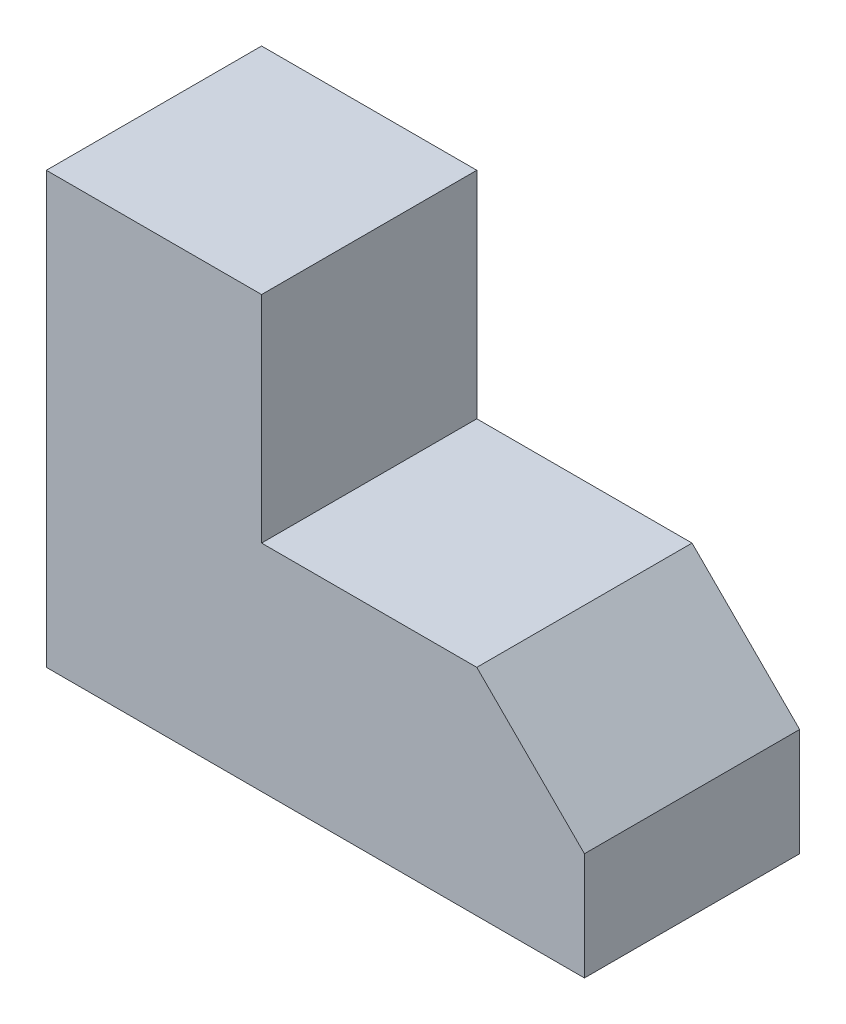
from build123d import *

# Parameters (mm, degrees)
BOSS_EXTRU_1_DEPTH = 10
CHANFREIN1_SIZE    = 5


with BuildPart() as part:
    # Esquisse1 → Boss.-Extru.1 (new body)
    with BuildSketch(Plane.XY):
        Polygon((0, 0), (0, 20), (10, 20), (10, 10), (25, 10), (25, 0), align=None)
    extrude(amount=BOSS_EXTRU_1_DEPTH)

    # Chanfrein1
    chanfrein1_edges = [part.edges().sort_by_distance(p)[0] for p in [
        (25, 10, 5),
    ]]
    chamfer(chanfrein1_edges, length=CHANFREIN1_SIZE)


solid = part.part
